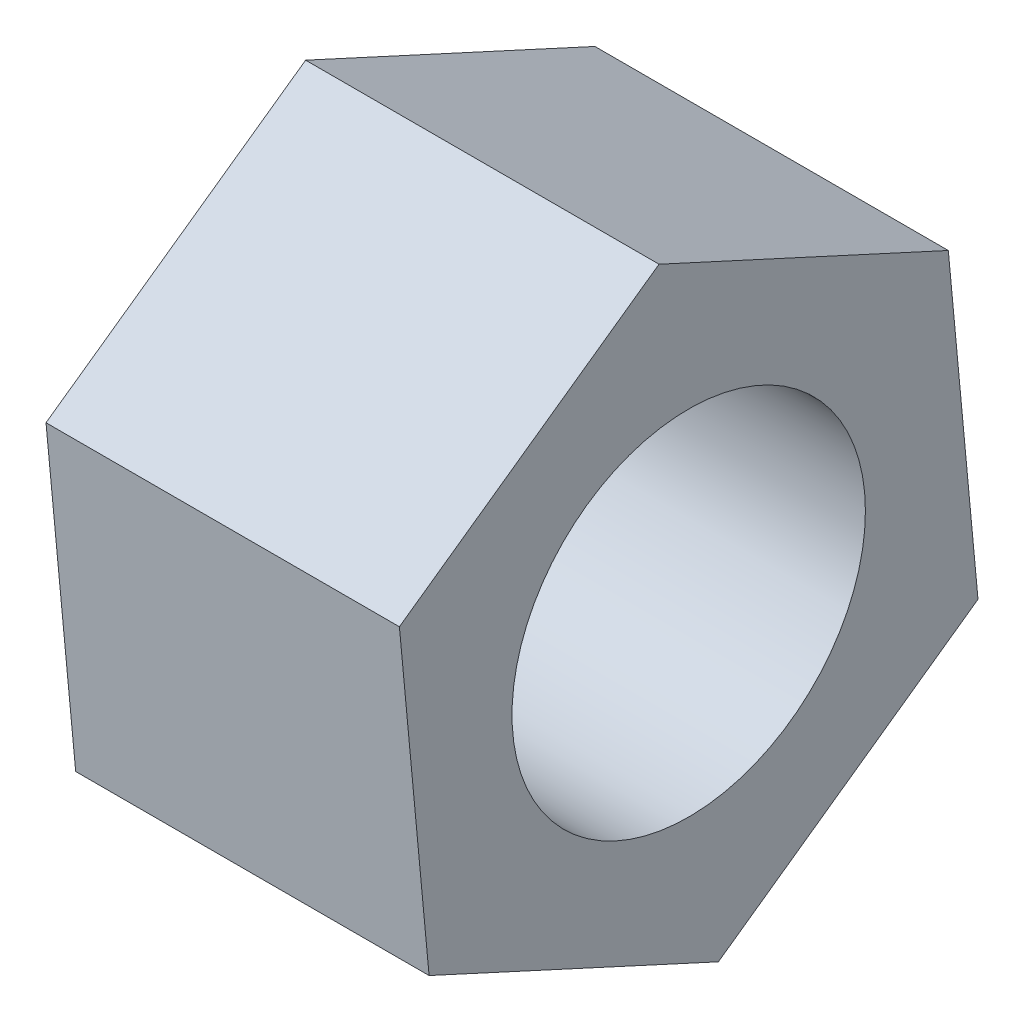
ISO-10303-21;
HEADER;
FILE_DESCRIPTION(('STEP AP214'),'2;1');
FILE_NAME('part.step','',(''),(''),'','','');
FILE_SCHEMA(('AUTOMOTIVE_DESIGN { 1 0 10303 214 1 1 1 1 }'));
ENDSEC;
DATA;
#1=APPLICATION_CONTEXT('core data for automotive mechanical design processes');
#2=APPLICATION_PROTOCOL_DEFINITION('international standard','automotive_design',2000,#1);
#3=PRODUCT_CONTEXT('',#1,'mechanical');
#4=PRODUCT('Part','Part','',(#3));
#5=PRODUCT_RELATED_PRODUCT_CATEGORY('part','',(#4));
#6=PRODUCT_DEFINITION_FORMATION('','',#4);
#7=PRODUCT_DEFINITION_CONTEXT('part definition',#1,'design');
#8=PRODUCT_DEFINITION('design','',#6,#7);
#9=PRODUCT_DEFINITION_SHAPE('','',#8);
#10=(LENGTH_UNIT() NAMED_UNIT(*) SI_UNIT(.MILLI.,.METRE.));
#11=(NAMED_UNIT(*) PLANE_ANGLE_UNIT() SI_UNIT($,.RADIAN.));
#12=(NAMED_UNIT(*) SI_UNIT($,.STERADIAN.) SOLID_ANGLE_UNIT());
#13=UNCERTAINTY_MEASURE_WITH_UNIT(LENGTH_MEASURE(1.E-05),#10,'distance_accuracy_value','');
#14=(GEOMETRIC_REPRESENTATION_CONTEXT(3) GLOBAL_UNCERTAINTY_ASSIGNED_CONTEXT((#13)) GLOBAL_UNIT_ASSIGNED_CONTEXT((#10,
#11,#12)) REPRESENTATION_CONTEXT('',''));
#15=CARTESIAN_POINT('',(0.,0.,0.));
#16=DIRECTION('',(0.,0.,1.));
#17=DIRECTION('',(1.,0.,0.));
#18=AXIS2_PLACEMENT_3D('',#15,#16,#17);
#19=CARTESIAN_POINT('',(1.,17.1575490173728,30.5402946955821));
#20=DIRECTION('',(1.,0.,0.));
#21=DIRECTION('',(0.,0.,-1.));
#22=AXIS2_PLACEMENT_3D('',#19,#20,#21);
#23=PLANE('',#22);
#24=DIRECTION('',(0.,-0.41706803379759,-0.908875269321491));
#25=VECTOR('',#24,1.);
#26=CARTESIAN_POINT('',(1.,17.5331881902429,31.3588881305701));
#27=LINE('',#26,#25);
#28=CARTESIAN_POINT('',(1.,17.5331881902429,31.3588881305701));
#29=VERTEX_POINT('',#28);
#30=CARTESIAN_POINT('',(1.,17.1575490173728,30.5402946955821));
#31=VERTEX_POINT('',#30);
#32=EDGE_CURVE('E128',#29,#31,#27,.T.);
#33=ORIENTED_EDGE('',*,*,#32,.T.);
#34=DIRECTION('',(0.,0.578575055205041,-0.815629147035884));
#35=VECTOR('',#34,1.);
#36=CARTESIAN_POINT('',(1.,17.1575490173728,30.5402946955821));
#37=LINE('',#36,#35);
#38=CARTESIAN_POINT('',(1.,17.6786521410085,29.805684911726));
#39=VERTEX_POINT('',#38);
#40=EDGE_CURVE('E86',#31,#39,#37,.T.);
#41=ORIENTED_EDGE('',*,*,#40,.T.);
#42=DIRECTION('',(0.,0.995643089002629,0.0932461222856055));
#43=VECTOR('',#42,1.);
#44=CARTESIAN_POINT('',(1.,17.6786521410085,29.805684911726));
#45=LINE('',#44,#43);
#46=CARTESIAN_POINT('',(1.,18.5753944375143,29.8896685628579));
#47=VERTEX_POINT('',#46);
#48=EDGE_CURVE('E99',#39,#47,#45,.T.);
#49=ORIENTED_EDGE('',*,*,#48,.T.);
#50=DIRECTION('',(0.,0.41706803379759,0.908875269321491));
#51=VECTOR('',#50,1.);
#52=CARTESIAN_POINT('',(1.,18.5753944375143,29.8896685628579));
#53=LINE('',#52,#51);
#54=CARTESIAN_POINT('',(1.,18.9510336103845,30.7082619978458));
#55=VERTEX_POINT('',#54);
#56=EDGE_CURVE('E93',#47,#55,#53,.T.);
#57=ORIENTED_EDGE('',*,*,#56,.T.);
#58=DIRECTION('',(0.,-0.578575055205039,0.815629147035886));
#59=VECTOR('',#58,1.);
#60=CARTESIAN_POINT('',(1.,18.9510336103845,30.7082619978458));
#61=LINE('',#60,#59);
#62=CARTESIAN_POINT('',(1.,18.4299304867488,31.442871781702));
#63=VERTEX_POINT('',#62);
#64=EDGE_CURVE('E97',#55,#63,#61,.T.);
#65=ORIENTED_EDGE('',*,*,#64,.T.);
#66=DIRECTION('',(0.,-0.995643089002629,-0.0932461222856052));
#67=VECTOR('',#66,1.);
#68=CARTESIAN_POINT('',(1.,18.4299304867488,31.442871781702));
#69=LINE('',#68,#67);
#70=EDGE_CURVE('E49',#63,#29,#69,.T.);
#71=ORIENTED_EDGE('',*,*,#70,.T.);
#72=EDGE_LOOP('',(#33,#41,#49,#57,#65,#71));
#73=FACE_BOUND('',#72,.T.);
#74=CARTESIAN_POINT('',(1.,18.0542913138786,30.624278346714));
#75=DIRECTION('',(1.,0.,0.));
#76=DIRECTION('',(0.,0.,-1.));
#77=AXIS2_PLACEMENT_3D('',#74,#75,#76);
#78=CIRCLE('',#77,0.499999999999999);
#79=CARTESIAN_POINT('',(1.,18.0542913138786,30.124278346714));
#80=VERTEX_POINT('',#79);
#81=EDGE_CURVE('E121',#80,#80,#78,.T.);
#82=ORIENTED_EDGE('',*,*,#81,.F.);
#83=EDGE_LOOP('',(#82));
#84=FACE_BOUND('',#83,.T.);
#85=ADVANCED_FACE('F32',(#73,#84),#23,.T.);
#86=CARTESIAN_POINT('',(0.,17.1575490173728,30.5402946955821));
#87=DIRECTION('',(1.,0.,0.));
#88=DIRECTION('',(0.,0.,-1.));
#89=AXIS2_PLACEMENT_3D('',#86,#87,#88);
#90=PLANE('',#89);
#91=DIRECTION('',(0.,-0.41706803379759,-0.908875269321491));
#92=VECTOR('',#91,1.);
#93=CARTESIAN_POINT('',(0.,17.5331881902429,31.3588881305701));
#94=LINE('',#93,#92);
#95=CARTESIAN_POINT('',(0.,17.5331881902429,31.3588881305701));
#96=VERTEX_POINT('',#95);
#97=CARTESIAN_POINT('',(0.,17.1575490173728,30.5402946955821));
#98=VERTEX_POINT('',#97);
#99=EDGE_CURVE('E117',#96,#98,#94,.T.);
#100=ORIENTED_EDGE('',*,*,#99,.F.);
#101=DIRECTION('',(0.,-0.995643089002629,-0.0932461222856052));
#102=VECTOR('',#101,1.);
#103=CARTESIAN_POINT('',(0.,18.4299304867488,31.442871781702));
#104=LINE('',#103,#102);
#105=CARTESIAN_POINT('',(0.,18.4299304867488,31.442871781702));
#106=VERTEX_POINT('',#105);
#107=EDGE_CURVE('E78',#106,#96,#104,.T.);
#108=ORIENTED_EDGE('',*,*,#107,.F.);
#109=DIRECTION('',(0.,-0.578575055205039,0.815629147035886));
#110=VECTOR('',#109,1.);
#111=CARTESIAN_POINT('',(0.,18.9510336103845,30.7082619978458));
#112=LINE('',#111,#110);
#113=CARTESIAN_POINT('',(0.,18.9510336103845,30.7082619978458));
#114=VERTEX_POINT('',#113);
#115=EDGE_CURVE('E72',#114,#106,#112,.T.);
#116=ORIENTED_EDGE('',*,*,#115,.F.);
#117=DIRECTION('',(0.,0.41706803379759,0.908875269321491));
#118=VECTOR('',#117,1.);
#119=CARTESIAN_POINT('',(0.,18.5753944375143,29.8896685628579));
#120=LINE('',#119,#118);
#121=CARTESIAN_POINT('',(0.,18.5753944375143,29.8896685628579));
#122=VERTEX_POINT('',#121);
#123=EDGE_CURVE('E107',#122,#114,#120,.T.);
#124=ORIENTED_EDGE('',*,*,#123,.F.);
#125=DIRECTION('',(0.,0.995643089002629,0.0932461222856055));
#126=VECTOR('',#125,1.);
#127=CARTESIAN_POINT('',(0.,17.6786521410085,29.805684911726));
#128=LINE('',#127,#126);
#129=CARTESIAN_POINT('',(0.,17.6786521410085,29.805684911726));
#130=VERTEX_POINT('',#129);
#131=EDGE_CURVE('E123',#130,#122,#128,.T.);
#132=ORIENTED_EDGE('',*,*,#131,.F.);
#133=DIRECTION('',(0.,0.578575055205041,-0.815629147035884));
#134=VECTOR('',#133,1.);
#135=CARTESIAN_POINT('',(0.,17.1575490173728,30.5402946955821));
#136=LINE('',#135,#134);
#137=EDGE_CURVE('E120',#98,#130,#136,.T.);
#138=ORIENTED_EDGE('',*,*,#137,.F.);
#139=EDGE_LOOP('',(#100,#108,#116,#124,#132,#138));
#140=FACE_BOUND('',#139,.T.);
#141=CARTESIAN_POINT('',(0.,18.0542913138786,30.624278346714));
#142=DIRECTION('',(1.,0.,0.));
#143=DIRECTION('',(0.,0.,-1.));
#144=AXIS2_PLACEMENT_3D('',#141,#142,#143);
#145=CIRCLE('',#144,0.499999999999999);
#146=CARTESIAN_POINT('',(0.,18.0542913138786,30.124278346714));
#147=VERTEX_POINT('',#146);
#148=EDGE_CURVE('E221',#147,#147,#145,.T.);
#149=ORIENTED_EDGE('',*,*,#148,.T.);
#150=EDGE_LOOP('',(#149));
#151=FACE_BOUND('',#150,.T.);
#152=ADVANCED_FACE('F137',(#140,#151),#90,.F.);
#153=CARTESIAN_POINT('',(1.,17.5331881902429,31.3588881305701));
#154=DIRECTION('',(0.,0.908875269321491,-0.41706803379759));
#155=DIRECTION('',(0.,0.41706803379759,0.908875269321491));
#156=AXIS2_PLACEMENT_3D('',#153,#154,#155);
#157=PLANE('',#156);
#158=ORIENTED_EDGE('',*,*,#99,.T.);
#159=DIRECTION('',(-1.,0.,0.));
#160=VECTOR('',#159,1.);
#161=CARTESIAN_POINT('',(1.,17.1575490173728,30.5402946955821));
#162=LINE('',#161,#160);
#163=EDGE_CURVE('E11',#31,#98,#162,.T.);
#164=ORIENTED_EDGE('',*,*,#163,.F.);
#165=ORIENTED_EDGE('',*,*,#32,.F.);
#166=DIRECTION('',(-1.,0.,0.));
#167=VECTOR('',#166,1.);
#168=CARTESIAN_POINT('',(1.,17.5331881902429,31.3588881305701));
#169=LINE('',#168,#167);
#170=EDGE_CURVE('E113',#29,#96,#169,.T.);
#171=ORIENTED_EDGE('',*,*,#170,.T.);
#172=EDGE_LOOP('',(#158,#164,#165,#171));
#173=FACE_BOUND('',#172,.T.);
#174=ADVANCED_FACE('F34',(#173),#157,.F.);
#175=CARTESIAN_POINT('',(1.,17.1575490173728,30.5402946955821));
#176=DIRECTION('',(0.,0.815629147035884,0.578575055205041));
#177=DIRECTION('',(0.,-0.578575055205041,0.815629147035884));
#178=AXIS2_PLACEMENT_3D('',#175,#176,#177);
#179=PLANE('',#178);
#180=ORIENTED_EDGE('',*,*,#137,.T.);
#181=DIRECTION('',(-1.,0.,0.));
#182=VECTOR('',#181,1.);
#183=CARTESIAN_POINT('',(1.,17.6786521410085,29.805684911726));
#184=LINE('',#183,#182);
#185=EDGE_CURVE('E41',#39,#130,#184,.T.);
#186=ORIENTED_EDGE('',*,*,#185,.F.);
#187=ORIENTED_EDGE('',*,*,#40,.F.);
#188=ORIENTED_EDGE('',*,*,#163,.T.);
#189=EDGE_LOOP('',(#180,#186,#187,#188));
#190=FACE_BOUND('',#189,.T.);
#191=ADVANCED_FACE('F162',(#190),#179,.F.);
#192=CARTESIAN_POINT('',(1.,17.6786521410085,29.805684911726));
#193=DIRECTION('',(0.,-0.0932461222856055,0.99564308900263));
#194=DIRECTION('',(0.,-0.99564308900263,-0.0932461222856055));
#195=AXIS2_PLACEMENT_3D('',#192,#193,#194);
#196=PLANE('',#195);
#197=ORIENTED_EDGE('',*,*,#131,.T.);
#198=DIRECTION('',(-1.,0.,0.));
#199=VECTOR('',#198,1.);
#200=CARTESIAN_POINT('',(1.,18.5753944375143,29.8896685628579));
#201=LINE('',#200,#199);
#202=EDGE_CURVE('E108',#47,#122,#201,.T.);
#203=ORIENTED_EDGE('',*,*,#202,.F.);
#204=ORIENTED_EDGE('',*,*,#48,.F.);
#205=ORIENTED_EDGE('',*,*,#185,.T.);
#206=EDGE_LOOP('',(#197,#203,#204,#205));
#207=FACE_BOUND('',#206,.T.);
#208=ADVANCED_FACE('F134',(#207),#196,.F.);
#209=CARTESIAN_POINT('',(1.,18.5753944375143,29.8896685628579));
#210=DIRECTION('',(0.,-0.908875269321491,0.41706803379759));
#211=DIRECTION('',(0.,-0.41706803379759,-0.908875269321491));
#212=AXIS2_PLACEMENT_3D('',#209,#210,#211);
#213=PLANE('',#212);
#214=ORIENTED_EDGE('',*,*,#123,.T.);
#215=DIRECTION('',(-1.,0.,0.));
#216=VECTOR('',#215,1.);
#217=CARTESIAN_POINT('',(1.,18.9510336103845,30.7082619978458));
#218=LINE('',#217,#216);
#219=EDGE_CURVE('E104',#55,#114,#218,.T.);
#220=ORIENTED_EDGE('',*,*,#219,.F.);
#221=ORIENTED_EDGE('',*,*,#56,.F.);
#222=ORIENTED_EDGE('',*,*,#202,.T.);
#223=EDGE_LOOP('',(#214,#220,#221,#222));
#224=FACE_BOUND('',#223,.T.);
#225=ADVANCED_FACE('F105',(#224),#213,.F.);
#226=CARTESIAN_POINT('',(1.,18.9510336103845,30.7082619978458));
#227=DIRECTION('',(0.,-0.815629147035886,-0.578575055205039));
#228=DIRECTION('',(0.,0.578575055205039,-0.815629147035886));
#229=AXIS2_PLACEMENT_3D('',#226,#227,#228);
#230=PLANE('',#229);
#231=ORIENTED_EDGE('',*,*,#115,.T.);
#232=DIRECTION('',(-1.,0.,0.));
#233=VECTOR('',#232,1.);
#234=CARTESIAN_POINT('',(1.,18.4299304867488,31.442871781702));
#235=LINE('',#234,#233);
#236=EDGE_CURVE('E109',#63,#106,#235,.T.);
#237=ORIENTED_EDGE('',*,*,#236,.F.);
#238=ORIENTED_EDGE('',*,*,#64,.F.);
#239=ORIENTED_EDGE('',*,*,#219,.T.);
#240=EDGE_LOOP('',(#231,#237,#238,#239));
#241=FACE_BOUND('',#240,.T.);
#242=ADVANCED_FACE('F111',(#241),#230,.F.);
#243=CARTESIAN_POINT('',(1.,18.4299304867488,31.442871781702));
#244=DIRECTION('',(0.,0.0932461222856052,-0.99564308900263));
#245=DIRECTION('',(0.,0.99564308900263,0.0932461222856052));
#246=AXIS2_PLACEMENT_3D('',#243,#244,#245);
#247=PLANE('',#246);
#248=ORIENTED_EDGE('',*,*,#107,.T.);
#249=ORIENTED_EDGE('',*,*,#170,.F.);
#250=ORIENTED_EDGE('',*,*,#70,.F.);
#251=ORIENTED_EDGE('',*,*,#236,.T.);
#252=EDGE_LOOP('',(#248,#249,#250,#251));
#253=FACE_BOUND('',#252,.T.);
#254=ADVANCED_FACE('F142',(#253),#247,.F.);
#255=CARTESIAN_POINT('',(1.,18.0542913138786,30.624278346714));
#256=DIRECTION('',(-1.,0.,0.));
#257=DIRECTION('',(0.,0.,1.));
#258=AXIS2_PLACEMENT_3D('',#255,#256,#257);
#259=CYLINDRICAL_SURFACE('',#258,0.499999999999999);
#260=ORIENTED_EDGE('',*,*,#81,.T.);
#261=EDGE_LOOP('',(#260));
#262=FACE_BOUND('',#261,.T.);
#263=ORIENTED_EDGE('',*,*,#148,.F.);
#264=EDGE_LOOP('',(#263));
#265=FACE_BOUND('',#264,.T.);
#266=ADVANCED_FACE('F144',(#262,#265),#259,.F.);
#267=CLOSED_SHELL('',(#85,#152,#174,#191,#208,#225,#242,#254,#266));
#268=MANIFOLD_SOLID_BREP('B2',#267);
#269=ADVANCED_BREP_SHAPE_REPRESENTATION('',(#18,#268),#14);
#270=SHAPE_DEFINITION_REPRESENTATION(#9,#269);
ENDSEC;
END-ISO-10303-21;
